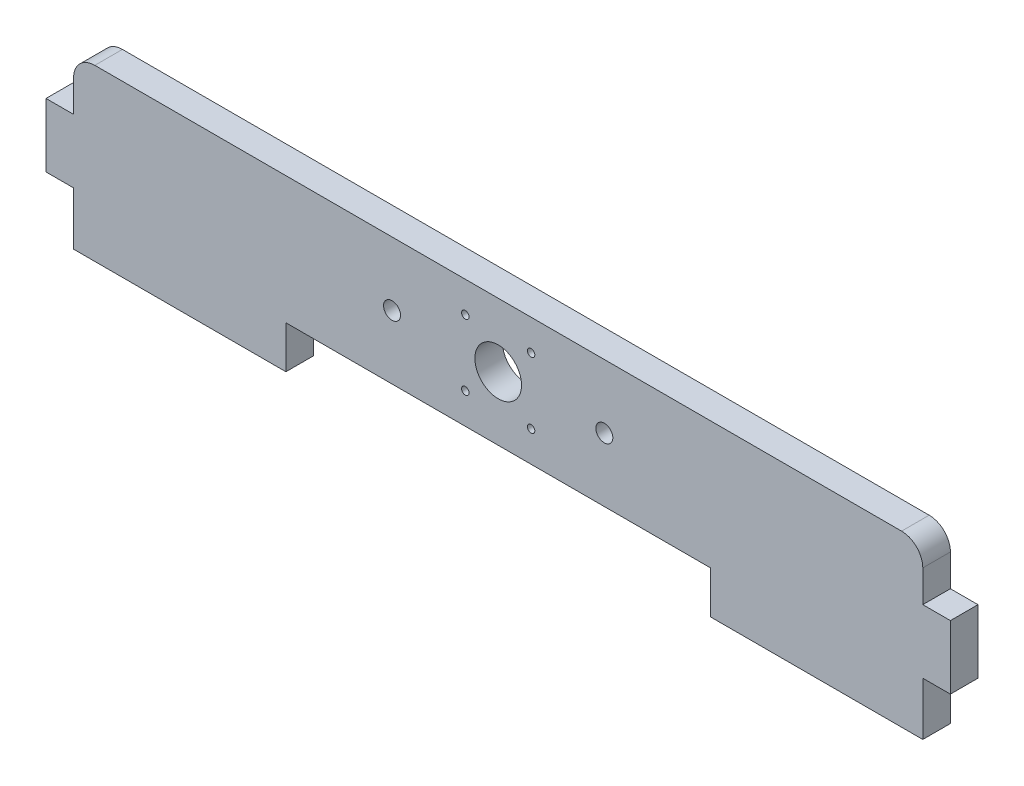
ISO-10303-21;
HEADER;
FILE_DESCRIPTION(('STEP AP214'),'2;1');
FILE_NAME('part.step','',(''),(''),'','','');
FILE_SCHEMA(('AUTOMOTIVE_DESIGN { 1 0 10303 214 1 1 1 1 }'));
ENDSEC;
DATA;
#1=APPLICATION_CONTEXT('core data for automotive mechanical design processes');
#2=APPLICATION_PROTOCOL_DEFINITION('international standard','automotive_design',2000,#1);
#3=PRODUCT_CONTEXT('',#1,'mechanical');
#4=PRODUCT('Part','Part','',(#3));
#5=PRODUCT_RELATED_PRODUCT_CATEGORY('part','',(#4));
#6=PRODUCT_DEFINITION_FORMATION('','',#4);
#7=PRODUCT_DEFINITION_CONTEXT('part definition',#1,'design');
#8=PRODUCT_DEFINITION('design','',#6,#7);
#9=PRODUCT_DEFINITION_SHAPE('','',#8);
#10=(LENGTH_UNIT() NAMED_UNIT(*) SI_UNIT(.MILLI.,.METRE.));
#11=(NAMED_UNIT(*) PLANE_ANGLE_UNIT() SI_UNIT($,.RADIAN.));
#12=(NAMED_UNIT(*) SI_UNIT($,.STERADIAN.) SOLID_ANGLE_UNIT());
#13=UNCERTAINTY_MEASURE_WITH_UNIT(LENGTH_MEASURE(1.E-05),#10,'distance_accuracy_value','');
#14=(GEOMETRIC_REPRESENTATION_CONTEXT(3) GLOBAL_UNCERTAINTY_ASSIGNED_CONTEXT((#13)) GLOBAL_UNIT_ASSIGNED_CONTEXT((#10,
#11,#12)) REPRESENTATION_CONTEXT('',''));
#15=CARTESIAN_POINT('',(0.,0.,0.));
#16=DIRECTION('',(0.,0.,1.));
#17=DIRECTION('',(1.,0.,0.));
#18=AXIS2_PLACEMENT_3D('',#15,#16,#17);
#19=CARTESIAN_POINT('',(200.,15.,13.));
#20=DIRECTION('',(-1.,0.,0.));
#21=DIRECTION('',(0.,0.,1.));
#22=AXIS2_PLACEMENT_3D('',#19,#20,#21);
#23=PLANE('',#22);
#24=DIRECTION('',(0.,1.,0.));
#25=VECTOR('',#24,1.);
#26=CARTESIAN_POINT('',(200.,15.,0.));
#27=LINE('',#26,#25);
#28=CARTESIAN_POINT('',(200.,15.,0.));
#29=VERTEX_POINT('',#28);
#30=CARTESIAN_POINT('',(200.,30.,0.));
#31=VERTEX_POINT('',#30);
#32=EDGE_CURVE('E221',#29,#31,#27,.T.);
#33=ORIENTED_EDGE('',*,*,#32,.T.);
#34=DIRECTION('',(0.,0.,-1.));
#35=VECTOR('',#34,1.);
#36=CARTESIAN_POINT('',(200.,30.,13.));
#37=LINE('',#36,#35);
#38=CARTESIAN_POINT('',(200.,30.,13.));
#39=VERTEX_POINT('',#38);
#40=EDGE_CURVE('E51',#31,#39,#37,.F.);
#41=ORIENTED_EDGE('',*,*,#40,.T.);
#42=DIRECTION('',(0.,1.,0.));
#43=VECTOR('',#42,1.);
#44=CARTESIAN_POINT('',(200.,15.,13.));
#45=LINE('',#44,#43);
#46=CARTESIAN_POINT('',(200.,15.,13.));
#47=VERTEX_POINT('',#46);
#48=EDGE_CURVE('E253',#47,#39,#45,.T.);
#49=ORIENTED_EDGE('',*,*,#48,.F.);
#50=DIRECTION('',(0.,0.,-1.));
#51=VECTOR('',#50,1.);
#52=CARTESIAN_POINT('',(200.,15.,13.));
#53=LINE('',#52,#51);
#54=EDGE_CURVE('E220',#47,#29,#53,.T.);
#55=ORIENTED_EDGE('',*,*,#54,.T.);
#56=EDGE_LOOP('',(#33,#41,#49,#55));
#57=FACE_BOUND('',#56,.T.);
#58=ADVANCED_FACE('F43',(#57),#23,.F.);
#59=CARTESIAN_POINT('',(-200.,40.,13.));
#60=DIRECTION('',(0.,-1.,0.));
#61=DIRECTION('',(0.,0.,-1.));
#62=AXIS2_PLACEMENT_3D('',#59,#60,#61);
#63=PLANE('',#62);
#64=DIRECTION('',(-1.,0.,0.));
#65=VECTOR('',#64,1.);
#66=CARTESIAN_POINT('',(-200.,40.,13.));
#67=LINE('',#66,#65);
#68=CARTESIAN_POINT('',(190.,40.,13.));
#69=VERTEX_POINT('',#68);
#70=CARTESIAN_POINT('',(-190.,40.,13.));
#71=VERTEX_POINT('',#70);
#72=EDGE_CURVE('E178',#69,#71,#67,.T.);
#73=ORIENTED_EDGE('',*,*,#72,.F.);
#74=DIRECTION('',(0.,0.,-1.));
#75=VECTOR('',#74,1.);
#76=CARTESIAN_POINT('',(190.,40.,13.));
#77=LINE('',#76,#75);
#78=CARTESIAN_POINT('',(190.,40.,0.));
#79=VERTEX_POINT('',#78);
#80=EDGE_CURVE('E298',#69,#79,#77,.T.);
#81=ORIENTED_EDGE('',*,*,#80,.T.);
#82=DIRECTION('',(-1.,0.,0.));
#83=VECTOR('',#82,1.);
#84=CARTESIAN_POINT('',(-200.,40.,0.));
#85=LINE('',#84,#83);
#86=CARTESIAN_POINT('',(-190.,40.,0.));
#87=VERTEX_POINT('',#86);
#88=EDGE_CURVE('E223',#79,#87,#85,.T.);
#89=ORIENTED_EDGE('',*,*,#88,.T.);
#90=DIRECTION('',(0.,0.,-1.));
#91=VECTOR('',#90,1.);
#92=CARTESIAN_POINT('',(-190.,40.,13.));
#93=LINE('',#92,#91);
#94=EDGE_CURVE('E294',#87,#71,#93,.F.);
#95=ORIENTED_EDGE('',*,*,#94,.T.);
#96=EDGE_LOOP('',(#73,#81,#89,#95));
#97=FACE_BOUND('',#96,.T.);
#98=ADVANCED_FACE('F304',(#97),#63,.F.);
#99=CARTESIAN_POINT('',(-200.,15.,13.));
#100=DIRECTION('',(1.,0.,0.));
#101=DIRECTION('',(0.,1.,0.));
#102=AXIS2_PLACEMENT_3D('',#99,#100,#101);
#103=PLANE('',#102);
#104=DIRECTION('',(0.,-1.,0.));
#105=VECTOR('',#104,1.);
#106=CARTESIAN_POINT('',(-200.,15.,13.));
#107=LINE('',#106,#105);
#108=CARTESIAN_POINT('',(-200.,29.9999999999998,13.));
#109=VERTEX_POINT('',#108);
#110=CARTESIAN_POINT('',(-200.,15.,13.));
#111=VERTEX_POINT('',#110);
#112=EDGE_CURVE('E167',#109,#111,#107,.T.);
#113=ORIENTED_EDGE('',*,*,#112,.F.);
#114=DIRECTION('',(0.,0.,-1.));
#115=VECTOR('',#114,1.);
#116=CARTESIAN_POINT('',(-200.,29.9999999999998,13.));
#117=LINE('',#116,#115);
#118=CARTESIAN_POINT('',(-200.,29.9999999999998,0.));
#119=VERTEX_POINT('',#118);
#120=EDGE_CURVE('E187',#109,#119,#117,.T.);
#121=ORIENTED_EDGE('',*,*,#120,.T.);
#122=DIRECTION('',(0.,-1.,0.));
#123=VECTOR('',#122,1.);
#124=CARTESIAN_POINT('',(-200.,15.,0.));
#125=LINE('',#124,#123);
#126=CARTESIAN_POINT('',(-200.,15.,0.));
#127=VERTEX_POINT('',#126);
#128=EDGE_CURVE('E184',#119,#127,#125,.T.);
#129=ORIENTED_EDGE('',*,*,#128,.T.);
#130=DIRECTION('',(0.,0.,-1.));
#131=VECTOR('',#130,1.);
#132=CARTESIAN_POINT('',(-200.,15.,13.));
#133=LINE('',#132,#131);
#134=EDGE_CURVE('E181',#111,#127,#133,.T.);
#135=ORIENTED_EDGE('',*,*,#134,.F.);
#136=EDGE_LOOP('',(#113,#121,#129,#135));
#137=FACE_BOUND('',#136,.T.);
#138=ADVANCED_FACE('F182',(#137),#103,.F.);
#139=CARTESIAN_POINT('',(-200.,15.,13.));
#140=DIRECTION('',(0.,-1.,0.));
#141=DIRECTION('',(1.,0.,0.));
#142=AXIS2_PLACEMENT_3D('',#139,#140,#141);
#143=PLANE('',#142);
#144=DIRECTION('',(-1.,0.,0.));
#145=VECTOR('',#144,1.);
#146=CARTESIAN_POINT('',(-200.,15.,0.));
#147=LINE('',#146,#145);
#148=CARTESIAN_POINT('',(-213.,15.,0.));
#149=VERTEX_POINT('',#148);
#150=EDGE_CURVE('E227',#127,#149,#147,.T.);
#151=ORIENTED_EDGE('',*,*,#150,.T.);
#152=DIRECTION('',(0.,0.,-1.));
#153=VECTOR('',#152,1.);
#154=CARTESIAN_POINT('',(-213.,15.,13.));
#155=LINE('',#154,#153);
#156=CARTESIAN_POINT('',(-213.,15.,13.));
#157=VERTEX_POINT('',#156);
#158=EDGE_CURVE('E188',#157,#149,#155,.T.);
#159=ORIENTED_EDGE('',*,*,#158,.F.);
#160=DIRECTION('',(-1.,0.,0.));
#161=VECTOR('',#160,1.);
#162=CARTESIAN_POINT('',(-200.,15.,13.));
#163=LINE('',#162,#161);
#164=EDGE_CURVE('E171',#111,#157,#163,.T.);
#165=ORIENTED_EDGE('',*,*,#164,.F.);
#166=ORIENTED_EDGE('',*,*,#134,.T.);
#167=EDGE_LOOP('',(#151,#159,#165,#166));
#168=FACE_BOUND('',#167,.T.);
#169=ADVANCED_FACE('F190',(#168),#143,.F.);
#170=CARTESIAN_POINT('',(-213.,15.,13.));
#171=DIRECTION('',(1.,0.,0.));
#172=DIRECTION('',(0.,0.,-1.));
#173=AXIS2_PLACEMENT_3D('',#170,#171,#172);
#174=PLANE('',#173);
#175=DIRECTION('',(0.,-1.,0.));
#176=VECTOR('',#175,1.);
#177=CARTESIAN_POINT('',(-213.,15.,0.));
#178=LINE('',#177,#176);
#179=CARTESIAN_POINT('',(-213.,-15.,0.));
#180=VERTEX_POINT('',#179);
#181=EDGE_CURVE('E229',#149,#180,#178,.T.);
#182=ORIENTED_EDGE('',*,*,#181,.T.);
#183=DIRECTION('',(0.,0.,-1.));
#184=VECTOR('',#183,1.);
#185=CARTESIAN_POINT('',(-213.,-15.,13.));
#186=LINE('',#185,#184);
#187=CARTESIAN_POINT('',(-213.,-15.,13.));
#188=VERTEX_POINT('',#187);
#189=EDGE_CURVE('E286',#188,#180,#186,.T.);
#190=ORIENTED_EDGE('',*,*,#189,.F.);
#191=DIRECTION('',(0.,-1.,0.));
#192=VECTOR('',#191,1.);
#193=CARTESIAN_POINT('',(-213.,15.,13.));
#194=LINE('',#193,#192);
#195=EDGE_CURVE('E193',#157,#188,#194,.T.);
#196=ORIENTED_EDGE('',*,*,#195,.F.);
#197=ORIENTED_EDGE('',*,*,#158,.T.);
#198=EDGE_LOOP('',(#182,#190,#196,#197));
#199=FACE_BOUND('',#198,.T.);
#200=ADVANCED_FACE('F331',(#199),#174,.F.);
#201=CARTESIAN_POINT('',(-200.,-15.,13.));
#202=DIRECTION('',(0.,1.,0.));
#203=DIRECTION('',(-1.,0.,0.));
#204=AXIS2_PLACEMENT_3D('',#201,#202,#203);
#205=PLANE('',#204);
#206=DIRECTION('',(1.,0.,0.));
#207=VECTOR('',#206,1.);
#208=CARTESIAN_POINT('',(-200.,-15.,0.));
#209=LINE('',#208,#207);
#210=CARTESIAN_POINT('',(-200.,-15.,0.));
#211=VERTEX_POINT('',#210);
#212=EDGE_CURVE('E231',#180,#211,#209,.T.);
#213=ORIENTED_EDGE('',*,*,#212,.T.);
#214=DIRECTION('',(0.,0.,-1.));
#215=VECTOR('',#214,1.);
#216=CARTESIAN_POINT('',(-200.,-15.,13.));
#217=LINE('',#216,#215);
#218=CARTESIAN_POINT('',(-200.,-15.,13.));
#219=VERTEX_POINT('',#218);
#220=EDGE_CURVE('E283',#219,#211,#217,.T.);
#221=ORIENTED_EDGE('',*,*,#220,.F.);
#222=DIRECTION('',(1.,0.,0.));
#223=VECTOR('',#222,1.);
#224=CARTESIAN_POINT('',(-200.,-15.,13.));
#225=LINE('',#224,#223);
#226=EDGE_CURVE('E195',#188,#219,#225,.T.);
#227=ORIENTED_EDGE('',*,*,#226,.F.);
#228=ORIENTED_EDGE('',*,*,#189,.T.);
#229=EDGE_LOOP('',(#213,#221,#227,#228));
#230=FACE_BOUND('',#229,.T.);
#231=ADVANCED_FACE('F334',(#230),#205,.F.);
#232=CARTESIAN_POINT('',(-200.,-40.,13.));
#233=DIRECTION('',(1.,0.,0.));
#234=DIRECTION('',(0.,1.,0.));
#235=AXIS2_PLACEMENT_3D('',#232,#233,#234);
#236=PLANE('',#235);
#237=DIRECTION('',(0.,-1.,0.));
#238=VECTOR('',#237,1.);
#239=CARTESIAN_POINT('',(-200.,-40.,0.));
#240=LINE('',#239,#238);
#241=CARTESIAN_POINT('',(-200.,-40.,0.));
#242=VERTEX_POINT('',#241);
#243=EDGE_CURVE('E233',#211,#242,#240,.T.);
#244=ORIENTED_EDGE('',*,*,#243,.T.);
#245=DIRECTION('',(0.,0.,-1.));
#246=VECTOR('',#245,1.);
#247=CARTESIAN_POINT('',(-200.,-40.,13.));
#248=LINE('',#247,#246);
#249=CARTESIAN_POINT('',(-200.,-40.,13.));
#250=VERTEX_POINT('',#249);
#251=EDGE_CURVE('E280',#250,#242,#248,.T.);
#252=ORIENTED_EDGE('',*,*,#251,.F.);
#253=DIRECTION('',(0.,-1.,0.));
#254=VECTOR('',#253,1.);
#255=CARTESIAN_POINT('',(-200.,-40.,13.));
#256=LINE('',#255,#254);
#257=EDGE_CURVE('E200',#219,#250,#256,.T.);
#258=ORIENTED_EDGE('',*,*,#257,.F.);
#259=ORIENTED_EDGE('',*,*,#220,.T.);
#260=EDGE_LOOP('',(#244,#252,#258,#259));
#261=FACE_BOUND('',#260,.T.);
#262=ADVANCED_FACE('F338',(#261),#236,.F.);
#263=CARTESIAN_POINT('',(-200.,-40.,13.));
#264=DIRECTION('',(0.,1.,0.));
#265=DIRECTION('',(-1.,0.,0.));
#266=AXIS2_PLACEMENT_3D('',#263,#264,#265);
#267=PLANE('',#266);
#268=DIRECTION('',(1.,0.,0.));
#269=VECTOR('',#268,1.);
#270=CARTESIAN_POINT('',(-200.,-40.,0.));
#271=LINE('',#270,#269);
#272=CARTESIAN_POINT('',(-100.,-40.,0.));
#273=VERTEX_POINT('',#272);
#274=EDGE_CURVE('E235',#242,#273,#271,.T.);
#275=ORIENTED_EDGE('',*,*,#274,.T.);
#276=DIRECTION('',(0.,0.,-1.));
#277=VECTOR('',#276,1.);
#278=CARTESIAN_POINT('',(-100.,-40.,13.));
#279=LINE('',#278,#277);
#280=CARTESIAN_POINT('',(-100.,-40.,13.));
#281=VERTEX_POINT('',#280);
#282=EDGE_CURVE('E277',#281,#273,#279,.T.);
#283=ORIENTED_EDGE('',*,*,#282,.F.);
#284=DIRECTION('',(1.,0.,0.));
#285=VECTOR('',#284,1.);
#286=CARTESIAN_POINT('',(-200.,-40.,13.));
#287=LINE('',#286,#285);
#288=EDGE_CURVE('E202',#250,#281,#287,.T.);
#289=ORIENTED_EDGE('',*,*,#288,.F.);
#290=ORIENTED_EDGE('',*,*,#251,.T.);
#291=EDGE_LOOP('',(#275,#283,#289,#290));
#292=FACE_BOUND('',#291,.T.);
#293=ADVANCED_FACE('F342',(#292),#267,.F.);
#294=CARTESIAN_POINT('',(-100.,-20.,13.));
#295=DIRECTION('',(-1.,0.,0.));
#296=DIRECTION('',(0.,0.,1.));
#297=AXIS2_PLACEMENT_3D('',#294,#295,#296);
#298=PLANE('',#297);
#299=DIRECTION('',(0.,1.,0.));
#300=VECTOR('',#299,1.);
#301=CARTESIAN_POINT('',(-100.,-20.,0.));
#302=LINE('',#301,#300);
#303=CARTESIAN_POINT('',(-100.,-20.,0.));
#304=VERTEX_POINT('',#303);
#305=EDGE_CURVE('E237',#273,#304,#302,.T.);
#306=ORIENTED_EDGE('',*,*,#305,.T.);
#307=DIRECTION('',(0.,0.,-1.));
#308=VECTOR('',#307,1.);
#309=CARTESIAN_POINT('',(-100.,-20.,13.));
#310=LINE('',#309,#308);
#311=CARTESIAN_POINT('',(-100.,-20.,13.));
#312=VERTEX_POINT('',#311);
#313=EDGE_CURVE('E274',#312,#304,#310,.T.);
#314=ORIENTED_EDGE('',*,*,#313,.F.);
#315=DIRECTION('',(0.,1.,0.));
#316=VECTOR('',#315,1.);
#317=CARTESIAN_POINT('',(-100.,-20.,13.));
#318=LINE('',#317,#316);
#319=EDGE_CURVE('E204',#281,#312,#318,.T.);
#320=ORIENTED_EDGE('',*,*,#319,.F.);
#321=ORIENTED_EDGE('',*,*,#282,.T.);
#322=EDGE_LOOP('',(#306,#314,#320,#321));
#323=FACE_BOUND('',#322,.T.);
#324=ADVANCED_FACE('F346',(#323),#298,.F.);
#325=CARTESIAN_POINT('',(-100.,-20.,13.));
#326=DIRECTION('',(0.,1.,0.));
#327=DIRECTION('',(0.,0.,1.));
#328=AXIS2_PLACEMENT_3D('',#325,#326,#327);
#329=PLANE('',#328);
#330=DIRECTION('',(1.,0.,0.));
#331=VECTOR('',#330,1.);
#332=CARTESIAN_POINT('',(-100.,-20.,0.));
#333=LINE('',#332,#331);
#334=CARTESIAN_POINT('',(100.,-20.,0.));
#335=VERTEX_POINT('',#334);
#336=EDGE_CURVE('E239',#304,#335,#333,.T.);
#337=ORIENTED_EDGE('',*,*,#336,.T.);
#338=DIRECTION('',(0.,0.,-1.));
#339=VECTOR('',#338,1.);
#340=CARTESIAN_POINT('',(100.,-20.,13.));
#341=LINE('',#340,#339);
#342=CARTESIAN_POINT('',(100.,-20.,13.));
#343=VERTEX_POINT('',#342);
#344=EDGE_CURVE('E271',#343,#335,#341,.T.);
#345=ORIENTED_EDGE('',*,*,#344,.F.);
#346=DIRECTION('',(1.,0.,0.));
#347=VECTOR('',#346,1.);
#348=CARTESIAN_POINT('',(-100.,-20.,13.));
#349=LINE('',#348,#347);
#350=EDGE_CURVE('E206',#312,#343,#349,.T.);
#351=ORIENTED_EDGE('',*,*,#350,.F.);
#352=ORIENTED_EDGE('',*,*,#313,.T.);
#353=EDGE_LOOP('',(#337,#345,#351,#352));
#354=FACE_BOUND('',#353,.T.);
#355=ADVANCED_FACE('F350',(#354),#329,.F.);
#356=CARTESIAN_POINT('',(100.,-20.,13.));
#357=DIRECTION('',(1.,0.,0.));
#358=DIRECTION('',(0.,0.,-1.));
#359=AXIS2_PLACEMENT_3D('',#356,#357,#358);
#360=PLANE('',#359);
#361=DIRECTION('',(0.,-1.,0.));
#362=VECTOR('',#361,1.);
#363=CARTESIAN_POINT('',(100.,-20.,0.));
#364=LINE('',#363,#362);
#365=CARTESIAN_POINT('',(100.,-40.,0.));
#366=VERTEX_POINT('',#365);
#367=EDGE_CURVE('E241',#335,#366,#364,.T.);
#368=ORIENTED_EDGE('',*,*,#367,.T.);
#369=DIRECTION('',(0.,0.,-1.));
#370=VECTOR('',#369,1.);
#371=CARTESIAN_POINT('',(100.,-40.,13.));
#372=LINE('',#371,#370);
#373=CARTESIAN_POINT('',(100.,-40.,13.));
#374=VERTEX_POINT('',#373);
#375=EDGE_CURVE('E268',#374,#366,#372,.T.);
#376=ORIENTED_EDGE('',*,*,#375,.F.);
#377=DIRECTION('',(0.,-1.,0.));
#378=VECTOR('',#377,1.);
#379=CARTESIAN_POINT('',(100.,-20.,13.));
#380=LINE('',#379,#378);
#381=EDGE_CURVE('E208',#343,#374,#380,.T.);
#382=ORIENTED_EDGE('',*,*,#381,.F.);
#383=ORIENTED_EDGE('',*,*,#344,.T.);
#384=EDGE_LOOP('',(#368,#376,#382,#383));
#385=FACE_BOUND('',#384,.T.);
#386=ADVANCED_FACE('F354',(#385),#360,.F.);
#387=CARTESIAN_POINT('',(100.,-40.,13.));
#388=DIRECTION('',(0.,1.,0.));
#389=DIRECTION('',(-1.,0.,0.));
#390=AXIS2_PLACEMENT_3D('',#387,#388,#389);
#391=PLANE('',#390);
#392=DIRECTION('',(1.,0.,0.));
#393=VECTOR('',#392,1.);
#394=CARTESIAN_POINT('',(100.,-40.,0.));
#395=LINE('',#394,#393);
#396=CARTESIAN_POINT('',(200.,-40.,0.));
#397=VERTEX_POINT('',#396);
#398=EDGE_CURVE('E243',#366,#397,#395,.T.);
#399=ORIENTED_EDGE('',*,*,#398,.T.);
#400=DIRECTION('',(0.,0.,-1.));
#401=VECTOR('',#400,1.);
#402=CARTESIAN_POINT('',(200.,-40.,13.));
#403=LINE('',#402,#401);
#404=CARTESIAN_POINT('',(200.,-40.,13.));
#405=VERTEX_POINT('',#404);
#406=EDGE_CURVE('E265',#405,#397,#403,.T.);
#407=ORIENTED_EDGE('',*,*,#406,.F.);
#408=DIRECTION('',(1.,0.,0.));
#409=VECTOR('',#408,1.);
#410=CARTESIAN_POINT('',(100.,-40.,13.));
#411=LINE('',#410,#409);
#412=EDGE_CURVE('E210',#374,#405,#411,.T.);
#413=ORIENTED_EDGE('',*,*,#412,.F.);
#414=ORIENTED_EDGE('',*,*,#375,.T.);
#415=EDGE_LOOP('',(#399,#407,#413,#414));
#416=FACE_BOUND('',#415,.T.);
#417=ADVANCED_FACE('F358',(#416),#391,.F.);
#418=CARTESIAN_POINT('',(200.,-40.,13.));
#419=DIRECTION('',(-1.,0.,0.));
#420=DIRECTION('',(0.,0.,1.));
#421=AXIS2_PLACEMENT_3D('',#418,#419,#420);
#422=PLANE('',#421);
#423=DIRECTION('',(0.,1.,0.));
#424=VECTOR('',#423,1.);
#425=CARTESIAN_POINT('',(200.,-40.,0.));
#426=LINE('',#425,#424);
#427=CARTESIAN_POINT('',(200.,-15.,0.));
#428=VERTEX_POINT('',#427);
#429=EDGE_CURVE('E245',#397,#428,#426,.T.);
#430=ORIENTED_EDGE('',*,*,#429,.T.);
#431=DIRECTION('',(0.,0.,-1.));
#432=VECTOR('',#431,1.);
#433=CARTESIAN_POINT('',(200.,-15.,13.));
#434=LINE('',#433,#432);
#435=CARTESIAN_POINT('',(200.,-15.,13.));
#436=VERTEX_POINT('',#435);
#437=EDGE_CURVE('E262',#436,#428,#434,.T.);
#438=ORIENTED_EDGE('',*,*,#437,.F.);
#439=DIRECTION('',(0.,1.,0.));
#440=VECTOR('',#439,1.);
#441=CARTESIAN_POINT('',(200.,-40.,13.));
#442=LINE('',#441,#440);
#443=EDGE_CURVE('E212',#405,#436,#442,.T.);
#444=ORIENTED_EDGE('',*,*,#443,.F.);
#445=ORIENTED_EDGE('',*,*,#406,.T.);
#446=EDGE_LOOP('',(#430,#438,#444,#445));
#447=FACE_BOUND('',#446,.T.);
#448=ADVANCED_FACE('F362',(#447),#422,.F.);
#449=CARTESIAN_POINT('',(200.,-15.,13.));
#450=DIRECTION('',(0.,1.,0.));
#451=DIRECTION('',(-1.,0.,0.));
#452=AXIS2_PLACEMENT_3D('',#449,#450,#451);
#453=PLANE('',#452);
#454=DIRECTION('',(1.,0.,0.));
#455=VECTOR('',#454,1.);
#456=CARTESIAN_POINT('',(200.,-15.,0.));
#457=LINE('',#456,#455);
#458=CARTESIAN_POINT('',(213.,-15.,0.));
#459=VERTEX_POINT('',#458);
#460=EDGE_CURVE('E247',#428,#459,#457,.T.);
#461=ORIENTED_EDGE('',*,*,#460,.T.);
#462=DIRECTION('',(0.,0.,-1.));
#463=VECTOR('',#462,1.);
#464=CARTESIAN_POINT('',(213.,-15.,13.));
#465=LINE('',#464,#463);
#466=CARTESIAN_POINT('',(213.,-15.,13.));
#467=VERTEX_POINT('',#466);
#468=EDGE_CURVE('E259',#467,#459,#465,.T.);
#469=ORIENTED_EDGE('',*,*,#468,.F.);
#470=DIRECTION('',(1.,0.,0.));
#471=VECTOR('',#470,1.);
#472=CARTESIAN_POINT('',(200.,-15.,13.));
#473=LINE('',#472,#471);
#474=EDGE_CURVE('E214',#436,#467,#473,.T.);
#475=ORIENTED_EDGE('',*,*,#474,.F.);
#476=ORIENTED_EDGE('',*,*,#437,.T.);
#477=EDGE_LOOP('',(#461,#469,#475,#476));
#478=FACE_BOUND('',#477,.T.);
#479=ADVANCED_FACE('F366',(#478),#453,.F.);
#480=CARTESIAN_POINT('',(213.,15.,13.));
#481=DIRECTION('',(-1.,0.,0.));
#482=DIRECTION('',(0.,0.,1.));
#483=AXIS2_PLACEMENT_3D('',#480,#481,#482);
#484=PLANE('',#483);
#485=DIRECTION('',(0.,1.,0.));
#486=VECTOR('',#485,1.);
#487=CARTESIAN_POINT('',(213.,15.,0.));
#488=LINE('',#487,#486);
#489=CARTESIAN_POINT('',(213.,15.,0.));
#490=VERTEX_POINT('',#489);
#491=EDGE_CURVE('E249',#459,#490,#488,.T.);
#492=ORIENTED_EDGE('',*,*,#491,.T.);
#493=DIRECTION('',(0.,0.,-1.));
#494=VECTOR('',#493,1.);
#495=CARTESIAN_POINT('',(213.,15.,13.));
#496=LINE('',#495,#494);
#497=CARTESIAN_POINT('',(213.,15.,13.));
#498=VERTEX_POINT('',#497);
#499=EDGE_CURVE('E256',#498,#490,#496,.T.);
#500=ORIENTED_EDGE('',*,*,#499,.F.);
#501=DIRECTION('',(0.,1.,0.));
#502=VECTOR('',#501,1.);
#503=CARTESIAN_POINT('',(213.,15.,13.));
#504=LINE('',#503,#502);
#505=EDGE_CURVE('E216',#467,#498,#504,.T.);
#506=ORIENTED_EDGE('',*,*,#505,.F.);
#507=ORIENTED_EDGE('',*,*,#468,.T.);
#508=EDGE_LOOP('',(#492,#500,#506,#507));
#509=FACE_BOUND('',#508,.T.);
#510=ADVANCED_FACE('F370',(#509),#484,.F.);
#511=CARTESIAN_POINT('',(200.,15.,13.));
#512=DIRECTION('',(0.,-1.,0.));
#513=DIRECTION('',(1.,0.,0.));
#514=AXIS2_PLACEMENT_3D('',#511,#512,#513);
#515=PLANE('',#514);
#516=DIRECTION('',(-1.,0.,0.));
#517=VECTOR('',#516,1.);
#518=CARTESIAN_POINT('',(200.,15.,0.));
#519=LINE('',#518,#517);
#520=EDGE_CURVE('E251',#490,#29,#519,.T.);
#521=ORIENTED_EDGE('',*,*,#520,.T.);
#522=ORIENTED_EDGE('',*,*,#54,.F.);
#523=DIRECTION('',(-1.,0.,0.));
#524=VECTOR('',#523,1.);
#525=CARTESIAN_POINT('',(200.,15.,13.));
#526=LINE('',#525,#524);
#527=EDGE_CURVE('E218',#498,#47,#526,.T.);
#528=ORIENTED_EDGE('',*,*,#527,.F.);
#529=ORIENTED_EDGE('',*,*,#499,.T.);
#530=EDGE_LOOP('',(#521,#522,#528,#529));
#531=FACE_BOUND('',#530,.T.);
#532=ADVANCED_FACE('F374',(#531),#515,.F.);
#533=CARTESIAN_POINT('',(0.,0.,13.));
#534=DIRECTION('',(0.,0.,-1.));
#535=DIRECTION('',(-1.,0.,0.));
#536=AXIS2_PLACEMENT_3D('',#533,#534,#535);
#537=PLANE('',#536);
#538=CARTESIAN_POINT('',(-15.5,-5.49999999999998,13.));
#539=DIRECTION('',(0.,0.,-1.));
#540=DIRECTION('',(-1.,0.,0.));
#541=AXIS2_PLACEMENT_3D('',#538,#539,#540);
#542=CIRCLE('',#541,1.75);
#543=CARTESIAN_POINT('',(-17.25,-5.49999999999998,13.));
#544=VERTEX_POINT('',#543);
#545=EDGE_CURVE('E417',#544,#544,#542,.T.);
#546=ORIENTED_EDGE('',*,*,#545,.T.);
#547=EDGE_LOOP('',(#546));
#548=FACE_BOUND('',#547,.T.);
#549=CARTESIAN_POINT('',(-15.5,25.5,13.));
#550=DIRECTION('',(0.,0.,-1.));
#551=DIRECTION('',(-1.,0.,0.));
#552=AXIS2_PLACEMENT_3D('',#549,#550,#551);
#553=CIRCLE('',#552,1.75);
#554=CARTESIAN_POINT('',(-17.25,25.5,13.));
#555=VERTEX_POINT('',#554);
#556=EDGE_CURVE('E434',#555,#555,#553,.T.);
#557=ORIENTED_EDGE('',*,*,#556,.T.);
#558=EDGE_LOOP('',(#557));
#559=FACE_BOUND('',#558,.T.);
#560=CARTESIAN_POINT('',(50.,10.,13.));
#561=DIRECTION('',(0.,0.,-1.));
#562=DIRECTION('',(-1.,0.,0.));
#563=AXIS2_PLACEMENT_3D('',#560,#561,#562);
#564=CIRCLE('',#563,4.00000000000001);
#565=CARTESIAN_POINT('',(46.,10.,13.));
#566=VERTEX_POINT('',#565);
#567=EDGE_CURVE('E433',#566,#566,#564,.T.);
#568=ORIENTED_EDGE('',*,*,#567,.T.);
#569=EDGE_LOOP('',(#568));
#570=FACE_BOUND('',#569,.T.);
#571=CARTESIAN_POINT('',(-50.,10.,13.));
#572=DIRECTION('',(0.,0.,-1.));
#573=DIRECTION('',(-1.,0.,0.));
#574=AXIS2_PLACEMENT_3D('',#571,#572,#573);
#575=CIRCLE('',#574,4.00000000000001);
#576=CARTESIAN_POINT('',(-54.,10.,13.));
#577=VERTEX_POINT('',#576);
#578=EDGE_CURVE('E443',#577,#577,#575,.T.);
#579=ORIENTED_EDGE('',*,*,#578,.T.);
#580=EDGE_LOOP('',(#579));
#581=FACE_BOUND('',#580,.T.);
#582=CARTESIAN_POINT('',(15.5,25.5,13.));
#583=DIRECTION('',(0.,0.,-1.));
#584=DIRECTION('',(-1.,0.,0.));
#585=AXIS2_PLACEMENT_3D('',#582,#583,#584);
#586=CIRCLE('',#585,1.75);
#587=CARTESIAN_POINT('',(13.75,25.5,13.));
#588=VERTEX_POINT('',#587);
#589=EDGE_CURVE('E412',#588,#588,#586,.T.);
#590=ORIENTED_EDGE('',*,*,#589,.T.);
#591=EDGE_LOOP('',(#590));
#592=FACE_BOUND('',#591,.T.);
#593=CARTESIAN_POINT('',(15.5,-5.49999999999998,13.));
#594=DIRECTION('',(0.,0.,-1.));
#595=DIRECTION('',(-1.,0.,0.));
#596=AXIS2_PLACEMENT_3D('',#593,#594,#595);
#597=CIRCLE('',#596,1.75);
#598=CARTESIAN_POINT('',(13.75,-5.49999999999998,13.));
#599=VERTEX_POINT('',#598);
#600=EDGE_CURVE('E427',#599,#599,#597,.T.);
#601=ORIENTED_EDGE('',*,*,#600,.T.);
#602=EDGE_LOOP('',(#601));
#603=FACE_BOUND('',#602,.T.);
#604=CARTESIAN_POINT('',(0.,10.,13.));
#605=DIRECTION('',(0.,0.,-1.));
#606=DIRECTION('',(-1.,0.,0.));
#607=AXIS2_PLACEMENT_3D('',#604,#605,#606);
#608=CIRCLE('',#607,11.);
#609=CARTESIAN_POINT('',(-11.0000000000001,10.,13.));
#610=VERTEX_POINT('',#609);
#611=EDGE_CURVE('E224',#610,#610,#608,.T.);
#612=ORIENTED_EDGE('',*,*,#611,.T.);
#613=EDGE_LOOP('',(#612));
#614=FACE_BOUND('',#613,.T.);
#615=ORIENTED_EDGE('',*,*,#48,.T.);
#616=CARTESIAN_POINT('',(190.,30.,13.));
#617=DIRECTION('',(0.,0.,-1.));
#618=DIRECTION('',(-1.,0.,0.));
#619=AXIS2_PLACEMENT_3D('',#616,#617,#618);
#620=CIRCLE('',#619,10.);
#621=EDGE_CURVE('E11',#39,#69,#620,.F.);
#622=ORIENTED_EDGE('',*,*,#621,.T.);
#623=ORIENTED_EDGE('',*,*,#72,.T.);
#624=CARTESIAN_POINT('',(-190.,30.,13.));
#625=DIRECTION('',(0.,0.,-1.));
#626=DIRECTION('',(-1.,0.,0.));
#627=AXIS2_PLACEMENT_3D('',#624,#625,#626);
#628=CIRCLE('',#627,10.);
#629=EDGE_CURVE('E174',#71,#109,#628,.F.);
#630=ORIENTED_EDGE('',*,*,#629,.T.);
#631=ORIENTED_EDGE('',*,*,#112,.T.);
#632=ORIENTED_EDGE('',*,*,#164,.T.);
#633=ORIENTED_EDGE('',*,*,#195,.T.);
#634=ORIENTED_EDGE('',*,*,#226,.T.);
#635=ORIENTED_EDGE('',*,*,#257,.T.);
#636=ORIENTED_EDGE('',*,*,#288,.T.);
#637=ORIENTED_EDGE('',*,*,#319,.T.);
#638=ORIENTED_EDGE('',*,*,#350,.T.);
#639=ORIENTED_EDGE('',*,*,#381,.T.);
#640=ORIENTED_EDGE('',*,*,#412,.T.);
#641=ORIENTED_EDGE('',*,*,#443,.T.);
#642=ORIENTED_EDGE('',*,*,#474,.T.);
#643=ORIENTED_EDGE('',*,*,#505,.T.);
#644=ORIENTED_EDGE('',*,*,#527,.T.);
#645=EDGE_LOOP('',(#615,#622,#623,#630,#631,#632,#633,#634,#635,#636,#637,#638,#639,#640,#641,
#642,#643,#644));
#646=FACE_BOUND('',#645,.T.);
#647=ADVANCED_FACE('F169',(#548,#559,#570,#581,#592,#603,#614,#646),#537,.F.);
#648=CARTESIAN_POINT('',(0.,0.,0.));
#649=DIRECTION('',(0.,0.,-1.));
#650=DIRECTION('',(-1.,0.,0.));
#651=AXIS2_PLACEMENT_3D('',#648,#649,#650);
#652=PLANE('',#651);
#653=CARTESIAN_POINT('',(-15.5,-5.49999999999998,0.));
#654=DIRECTION('',(0.,0.,-1.));
#655=DIRECTION('',(-1.,0.,0.));
#656=AXIS2_PLACEMENT_3D('',#653,#654,#655);
#657=CIRCLE('',#656,1.75);
#658=CARTESIAN_POINT('',(-17.25,-5.49999999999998,0.));
#659=VERTEX_POINT('',#658);
#660=EDGE_CURVE('E420',#659,#659,#657,.T.);
#661=ORIENTED_EDGE('',*,*,#660,.F.);
#662=EDGE_LOOP('',(#661));
#663=FACE_BOUND('',#662,.T.);
#664=CARTESIAN_POINT('',(-15.5,25.5,0.));
#665=DIRECTION('',(0.,0.,-1.));
#666=DIRECTION('',(-1.,0.,0.));
#667=AXIS2_PLACEMENT_3D('',#664,#665,#666);
#668=CIRCLE('',#667,1.75);
#669=CARTESIAN_POINT('',(-17.25,25.5,0.));
#670=VERTEX_POINT('',#669);
#671=EDGE_CURVE('E430',#670,#670,#668,.T.);
#672=ORIENTED_EDGE('',*,*,#671,.F.);
#673=EDGE_LOOP('',(#672));
#674=FACE_BOUND('',#673,.T.);
#675=CARTESIAN_POINT('',(50.,10.,0.));
#676=DIRECTION('',(0.,0.,-1.));
#677=DIRECTION('',(-1.,0.,0.));
#678=AXIS2_PLACEMENT_3D('',#675,#676,#677);
#679=CIRCLE('',#678,4.00000000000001);
#680=CARTESIAN_POINT('',(46.,10.,0.));
#681=VERTEX_POINT('',#680);
#682=EDGE_CURVE('E446',#681,#681,#679,.T.);
#683=ORIENTED_EDGE('',*,*,#682,.F.);
#684=EDGE_LOOP('',(#683));
#685=FACE_BOUND('',#684,.T.);
#686=CARTESIAN_POINT('',(-50.,10.,0.));
#687=DIRECTION('',(0.,0.,-1.));
#688=DIRECTION('',(-1.,0.,0.));
#689=AXIS2_PLACEMENT_3D('',#686,#687,#688);
#690=CIRCLE('',#689,4.00000000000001);
#691=CARTESIAN_POINT('',(-54.,10.,0.));
#692=VERTEX_POINT('',#691);
#693=EDGE_CURVE('E439',#692,#692,#690,.T.);
#694=ORIENTED_EDGE('',*,*,#693,.F.);
#695=EDGE_LOOP('',(#694));
#696=FACE_BOUND('',#695,.T.);
#697=CARTESIAN_POINT('',(15.5,25.5,0.));
#698=DIRECTION('',(0.,0.,-1.));
#699=DIRECTION('',(-1.,0.,0.));
#700=AXIS2_PLACEMENT_3D('',#697,#698,#699);
#701=CIRCLE('',#700,1.75);
#702=CARTESIAN_POINT('',(13.75,25.5,0.));
#703=VERTEX_POINT('',#702);
#704=EDGE_CURVE('E415',#703,#703,#701,.T.);
#705=ORIENTED_EDGE('',*,*,#704,.F.);
#706=EDGE_LOOP('',(#705));
#707=FACE_BOUND('',#706,.T.);
#708=CARTESIAN_POINT('',(15.5,-5.49999999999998,0.));
#709=DIRECTION('',(0.,0.,-1.));
#710=DIRECTION('',(-1.,0.,0.));
#711=AXIS2_PLACEMENT_3D('',#708,#709,#710);
#712=CIRCLE('',#711,1.75);
#713=CARTESIAN_POINT('',(13.75,-5.49999999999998,0.));
#714=VERTEX_POINT('',#713);
#715=EDGE_CURVE('E422',#714,#714,#712,.T.);
#716=ORIENTED_EDGE('',*,*,#715,.F.);
#717=EDGE_LOOP('',(#716));
#718=FACE_BOUND('',#717,.T.);
#719=CARTESIAN_POINT('',(0.,10.,0.));
#720=DIRECTION('',(0.,0.,-1.));
#721=DIRECTION('',(-1.,0.,0.));
#722=AXIS2_PLACEMENT_3D('',#719,#720,#721);
#723=CIRCLE('',#722,11.);
#724=CARTESIAN_POINT('',(-11.0000000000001,10.,0.));
#725=VERTEX_POINT('',#724);
#726=EDGE_CURVE('E442',#725,#725,#723,.T.);
#727=ORIENTED_EDGE('',*,*,#726,.F.);
#728=EDGE_LOOP('',(#727));
#729=FACE_BOUND('',#728,.T.);
#730=ORIENTED_EDGE('',*,*,#88,.F.);
#731=CARTESIAN_POINT('',(190.,30.,0.));
#732=DIRECTION('',(0.,0.,-1.));
#733=DIRECTION('',(-1.,0.,0.));
#734=AXIS2_PLACEMENT_3D('',#731,#732,#733);
#735=CIRCLE('',#734,10.);
#736=EDGE_CURVE('E65',#79,#31,#735,.T.);
#737=ORIENTED_EDGE('',*,*,#736,.T.);
#738=ORIENTED_EDGE('',*,*,#32,.F.);
#739=ORIENTED_EDGE('',*,*,#520,.F.);
#740=ORIENTED_EDGE('',*,*,#491,.F.);
#741=ORIENTED_EDGE('',*,*,#460,.F.);
#742=ORIENTED_EDGE('',*,*,#429,.F.);
#743=ORIENTED_EDGE('',*,*,#398,.F.);
#744=ORIENTED_EDGE('',*,*,#367,.F.);
#745=ORIENTED_EDGE('',*,*,#336,.F.);
#746=ORIENTED_EDGE('',*,*,#305,.F.);
#747=ORIENTED_EDGE('',*,*,#274,.F.);
#748=ORIENTED_EDGE('',*,*,#243,.F.);
#749=ORIENTED_EDGE('',*,*,#212,.F.);
#750=ORIENTED_EDGE('',*,*,#181,.F.);
#751=ORIENTED_EDGE('',*,*,#150,.F.);
#752=ORIENTED_EDGE('',*,*,#128,.F.);
#753=CARTESIAN_POINT('',(-190.,30.,0.));
#754=DIRECTION('',(0.,0.,-1.));
#755=DIRECTION('',(-1.,0.,0.));
#756=AXIS2_PLACEMENT_3D('',#753,#754,#755);
#757=CIRCLE('',#756,10.);
#758=EDGE_CURVE('E291',#119,#87,#757,.T.);
#759=ORIENTED_EDGE('',*,*,#758,.T.);
#760=EDGE_LOOP('',(#730,#737,#738,#739,#740,#741,#742,#743,#744,#745,#746,#747,#748,#749,#750,
#751,#752,#759));
#761=FACE_BOUND('',#760,.T.);
#762=ADVANCED_FACE('F307',(#663,#674,#685,#696,#707,#718,#729,#761),#652,.T.);
#763=CARTESIAN_POINT('',(0.,10.,13.));
#764=DIRECTION('',(0.,0.,-1.));
#765=DIRECTION('',(-1.,0.,0.));
#766=AXIS2_PLACEMENT_3D('',#763,#764,#765);
#767=CYLINDRICAL_SURFACE('',#766,11.);
#768=ORIENTED_EDGE('',*,*,#611,.F.);
#769=EDGE_LOOP('',(#768));
#770=FACE_BOUND('',#769,.T.);
#771=ORIENTED_EDGE('',*,*,#726,.T.);
#772=EDGE_LOOP('',(#771));
#773=FACE_BOUND('',#772,.T.);
#774=ADVANCED_FACE('F381',(#770,#773),#767,.F.);
#775=CARTESIAN_POINT('',(15.5,-5.49999999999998,13.));
#776=DIRECTION('',(0.,0.,-1.));
#777=DIRECTION('',(-1.,0.,0.));
#778=AXIS2_PLACEMENT_3D('',#775,#776,#777);
#779=CYLINDRICAL_SURFACE('',#778,1.75);
#780=ORIENTED_EDGE('',*,*,#600,.F.);
#781=EDGE_LOOP('',(#780));
#782=FACE_BOUND('',#781,.T.);
#783=ORIENTED_EDGE('',*,*,#715,.T.);
#784=EDGE_LOOP('',(#783));
#785=FACE_BOUND('',#784,.T.);
#786=ADVANCED_FACE('F388',(#782,#785),#779,.F.);
#787=CARTESIAN_POINT('',(15.5,25.5,13.));
#788=DIRECTION('',(0.,0.,-1.));
#789=DIRECTION('',(-1.,0.,0.));
#790=AXIS2_PLACEMENT_3D('',#787,#788,#789);
#791=CYLINDRICAL_SURFACE('',#790,1.75);
#792=ORIENTED_EDGE('',*,*,#589,.F.);
#793=EDGE_LOOP('',(#792));
#794=FACE_BOUND('',#793,.T.);
#795=ORIENTED_EDGE('',*,*,#704,.T.);
#796=EDGE_LOOP('',(#795));
#797=FACE_BOUND('',#796,.T.);
#798=ADVANCED_FACE('F396',(#794,#797),#791,.F.);
#799=CARTESIAN_POINT('',(-50.,10.,13.));
#800=DIRECTION('',(0.,0.,-1.));
#801=DIRECTION('',(-1.,0.,0.));
#802=AXIS2_PLACEMENT_3D('',#799,#800,#801);
#803=CYLINDRICAL_SURFACE('',#802,4.00000000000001);
#804=ORIENTED_EDGE('',*,*,#578,.F.);
#805=EDGE_LOOP('',(#804));
#806=FACE_BOUND('',#805,.T.);
#807=ORIENTED_EDGE('',*,*,#693,.T.);
#808=EDGE_LOOP('',(#807));
#809=FACE_BOUND('',#808,.T.);
#810=ADVANCED_FACE('F393',(#806,#809),#803,.F.);
#811=CARTESIAN_POINT('',(50.,10.,13.));
#812=DIRECTION('',(0.,0.,-1.));
#813=DIRECTION('',(-1.,0.,0.));
#814=AXIS2_PLACEMENT_3D('',#811,#812,#813);
#815=CYLINDRICAL_SURFACE('',#814,4.00000000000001);
#816=ORIENTED_EDGE('',*,*,#567,.F.);
#817=EDGE_LOOP('',(#816));
#818=FACE_BOUND('',#817,.T.);
#819=ORIENTED_EDGE('',*,*,#682,.T.);
#820=EDGE_LOOP('',(#819));
#821=FACE_BOUND('',#820,.T.);
#822=ADVANCED_FACE('F390',(#818,#821),#815,.F.);
#823=CARTESIAN_POINT('',(-15.5,25.5,13.));
#824=DIRECTION('',(0.,0.,-1.));
#825=DIRECTION('',(-1.,0.,0.));
#826=AXIS2_PLACEMENT_3D('',#823,#824,#825);
#827=CYLINDRICAL_SURFACE('',#826,1.75);
#828=ORIENTED_EDGE('',*,*,#556,.F.);
#829=EDGE_LOOP('',(#828));
#830=FACE_BOUND('',#829,.T.);
#831=ORIENTED_EDGE('',*,*,#671,.T.);
#832=EDGE_LOOP('',(#831));
#833=FACE_BOUND('',#832,.T.);
#834=ADVANCED_FACE('F317',(#830,#833),#827,.F.);
#835=CARTESIAN_POINT('',(-15.5,-5.49999999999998,13.));
#836=DIRECTION('',(0.,0.,-1.));
#837=DIRECTION('',(-1.,0.,0.));
#838=AXIS2_PLACEMENT_3D('',#835,#836,#837);
#839=CYLINDRICAL_SURFACE('',#838,1.75);
#840=ORIENTED_EDGE('',*,*,#545,.F.);
#841=EDGE_LOOP('',(#840));
#842=FACE_BOUND('',#841,.T.);
#843=ORIENTED_EDGE('',*,*,#660,.T.);
#844=EDGE_LOOP('',(#843));
#845=FACE_BOUND('',#844,.T.);
#846=ADVANCED_FACE('F312',(#842,#845),#839,.F.);
#847=CARTESIAN_POINT('',(-190.,30.,13.));
#848=DIRECTION('',(0.,0.,-1.));
#849=DIRECTION('',(-1.,0.,0.));
#850=AXIS2_PLACEMENT_3D('',#847,#848,#849);
#851=CYLINDRICAL_SURFACE('',#850,10.);
#852=ORIENTED_EDGE('',*,*,#629,.F.);
#853=ORIENTED_EDGE('',*,*,#94,.F.);
#854=ORIENTED_EDGE('',*,*,#758,.F.);
#855=ORIENTED_EDGE('',*,*,#120,.F.);
#856=EDGE_LOOP('',(#852,#853,#854,#855));
#857=FACE_BOUND('',#856,.T.);
#858=ADVANCED_FACE('F310',(#857),#851,.T.);
#859=CARTESIAN_POINT('',(190.,30.,13.));
#860=DIRECTION('',(0.,0.,-1.));
#861=DIRECTION('',(-1.,0.,0.));
#862=AXIS2_PLACEMENT_3D('',#859,#860,#861);
#863=CYLINDRICAL_SURFACE('',#862,10.);
#864=ORIENTED_EDGE('',*,*,#621,.F.);
#865=ORIENTED_EDGE('',*,*,#40,.F.);
#866=ORIENTED_EDGE('',*,*,#736,.F.);
#867=ORIENTED_EDGE('',*,*,#80,.F.);
#868=EDGE_LOOP('',(#864,#865,#866,#867));
#869=FACE_BOUND('',#868,.T.);
#870=ADVANCED_FACE('F45',(#869),#863,.T.);
#871=CLOSED_SHELL('',(#58,#98,#138,#169,#200,#231,#262,#293,#324,#355,#386,#417,#448,#479,#510,
#532,#647,#762,#774,#786,#798,#810,#822,#834,#846,#858,#870));
#872=MANIFOLD_SOLID_BREP('B2',#871);
#873=ADVANCED_BREP_SHAPE_REPRESENTATION('',(#18,#872),#14);
#874=SHAPE_DEFINITION_REPRESENTATION(#9,#873);
ENDSEC;
END-ISO-10303-21;
